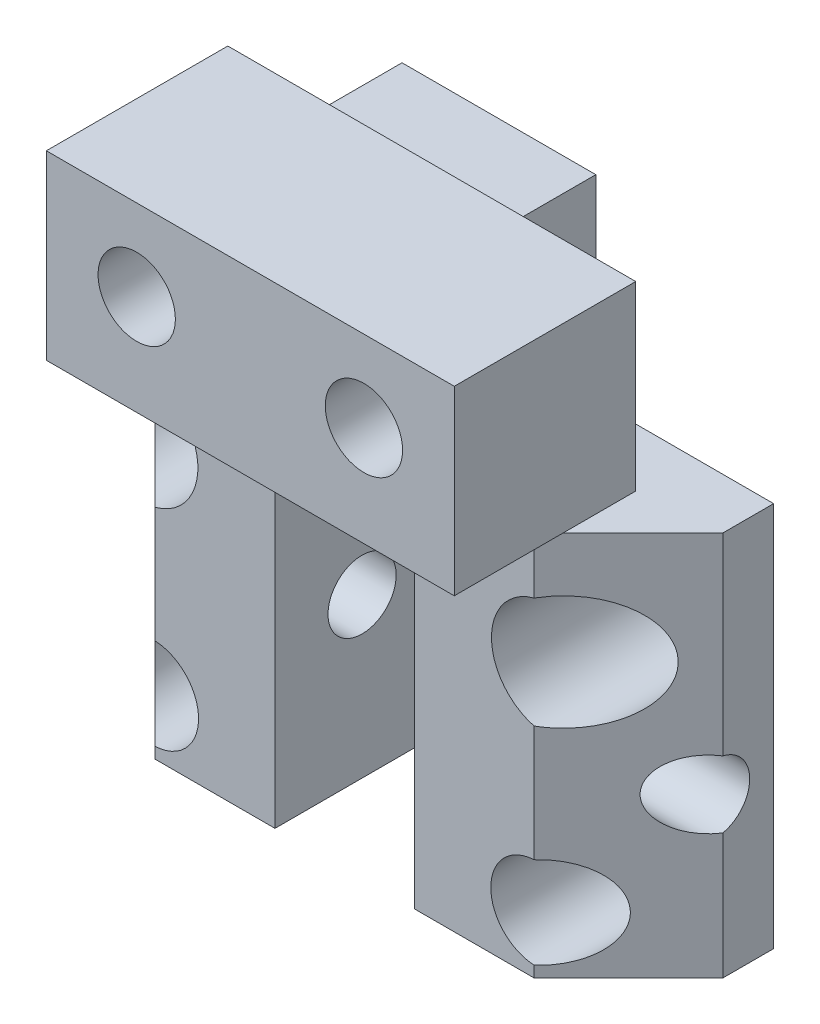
ISO-10303-21;
HEADER;
FILE_DESCRIPTION(('STEP AP214'),'2;1');
FILE_NAME('part.step','',(''),(''),'','','');
FILE_SCHEMA(('AUTOMOTIVE_DESIGN { 1 0 10303 214 1 1 1 1 }'));
ENDSEC;
DATA;
#1=APPLICATION_CONTEXT('core data for automotive mechanical design processes');
#2=APPLICATION_PROTOCOL_DEFINITION('international standard','automotive_design',2000,#1);
#3=PRODUCT_CONTEXT('',#1,'mechanical');
#4=PRODUCT('Part','Part','',(#3));
#5=PRODUCT_RELATED_PRODUCT_CATEGORY('part','',(#4));
#6=PRODUCT_DEFINITION_FORMATION('','',#4);
#7=PRODUCT_DEFINITION_CONTEXT('part definition',#1,'design');
#8=PRODUCT_DEFINITION('design','',#6,#7);
#9=PRODUCT_DEFINITION_SHAPE('','',#8);
#10=(LENGTH_UNIT() NAMED_UNIT(*) SI_UNIT(.MILLI.,.METRE.));
#11=(NAMED_UNIT(*) PLANE_ANGLE_UNIT() SI_UNIT($,.RADIAN.));
#12=(NAMED_UNIT(*) SI_UNIT($,.STERADIAN.) SOLID_ANGLE_UNIT());
#13=UNCERTAINTY_MEASURE_WITH_UNIT(LENGTH_MEASURE(1.E-05),#10,'distance_accuracy_value','');
#14=(GEOMETRIC_REPRESENTATION_CONTEXT(3) GLOBAL_UNCERTAINTY_ASSIGNED_CONTEXT((#13)) GLOBAL_UNIT_ASSIGNED_CONTEXT((#10,
#11,#12)) REPRESENTATION_CONTEXT('',''));
#15=CARTESIAN_POINT('',(0.,0.,0.));
#16=DIRECTION('',(0.,0.,1.));
#17=DIRECTION('',(1.,0.,0.));
#18=AXIS2_PLACEMENT_3D('',#15,#16,#17);
#19=CARTESIAN_POINT('',(-6.7818,-6.7437,0.));
#20=DIRECTION('',(0.,-1.,0.));
#21=DIRECTION('',(0.,0.,-1.));
#22=AXIS2_PLACEMENT_3D('',#19,#20,#21);
#23=PLANE('',#22);
#24=DIRECTION('',(1.,0.,0.));
#25=VECTOR('',#24,1.);
#26=CARTESIAN_POINT('',(13.081,-6.7437,5.08000000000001));
#27=LINE('',#26,#25);
#28=CARTESIAN_POINT('',(-3.4798,-6.7437,5.08000000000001));
#29=VERTEX_POINT('',#28);
#30=CARTESIAN_POINT('',(0.711199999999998,-6.7437,5.08000000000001));
#31=VERTEX_POINT('',#30);
#32=EDGE_CURVE('E267',#29,#31,#27,.T.);
#33=ORIENTED_EDGE('',*,*,#32,.F.);
#34=DIRECTION('',(0.707106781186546,0.,0.707106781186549));
#35=VECTOR('',#34,1.);
#36=CARTESIAN_POINT('',(-7.67079999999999,-6.7437,0.888999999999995));
#37=LINE('',#36,#35);
#38=CARTESIAN_POINT('',(-6.7818,-6.7437,1.77799999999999));
#39=VERTEX_POINT('',#38);
#40=EDGE_CURVE('E204',#29,#39,#37,.F.);
#41=ORIENTED_EDGE('',*,*,#40,.T.);
#42=DIRECTION('',(0.,0.,1.));
#43=VECTOR('',#42,1.);
#44=CARTESIAN_POINT('',(-6.7818,-6.7437,5.08000000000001));
#45=LINE('',#44,#43);
#46=CARTESIAN_POINT('',(-6.7818,-6.7437,-6.85799999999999));
#47=VERTEX_POINT('',#46);
#48=EDGE_CURVE('E281',#47,#39,#45,.T.);
#49=ORIENTED_EDGE('',*,*,#48,.F.);
#50=DIRECTION('',(-1.,0.,0.));
#51=VECTOR('',#50,1.);
#52=CARTESIAN_POINT('',(-6.7818,-6.7437,-6.85799999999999));
#53=LINE('',#52,#51);
#54=CARTESIAN_POINT('',(0.,-6.7437,-6.85799999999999));
#55=VERTEX_POINT('',#54);
#56=EDGE_CURVE('E290',#55,#47,#53,.T.);
#57=ORIENTED_EDGE('',*,*,#56,.F.);
#58=DIRECTION('',(0.,0.,-1.));
#59=VECTOR('',#58,1.);
#60=CARTESIAN_POINT('',(0.,-6.7437,-6.85799999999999));
#61=LINE('',#60,#59);
#62=CARTESIAN_POINT('',(0.,-6.7437,0.));
#63=VERTEX_POINT('',#62);
#64=EDGE_CURVE('E288',#63,#55,#61,.T.);
#65=ORIENTED_EDGE('',*,*,#64,.F.);
#66=DIRECTION('',(-1.,0.,0.));
#67=VECTOR('',#66,1.);
#68=CARTESIAN_POINT('',(0.,-6.7437,0.));
#69=LINE('',#68,#67);
#70=CARTESIAN_POINT('',(0.711199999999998,-6.7437,0.));
#71=VERTEX_POINT('',#70);
#72=EDGE_CURVE('E279',#71,#63,#69,.T.);
#73=ORIENTED_EDGE('',*,*,#72,.F.);
#74=DIRECTION('',(0.,0.,-1.));
#75=VECTOR('',#74,1.);
#76=CARTESIAN_POINT('',(0.711199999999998,-6.7437,0.));
#77=LINE('',#76,#75);
#78=EDGE_CURVE('E275',#31,#71,#77,.T.);
#79=ORIENTED_EDGE('',*,*,#78,.F.);
#80=EDGE_LOOP('',(#33,#41,#49,#57,#65,#73,#79));
#81=FACE_BOUND('',#80,.T.);
#82=ADVANCED_FACE('F34',(#81),#23,.T.);
#83=CARTESIAN_POINT('',(-6.7818,6.7437,0.));
#84=DIRECTION('',(0.,-1.,0.));
#85=DIRECTION('',(0.,0.,-1.));
#86=AXIS2_PLACEMENT_3D('',#83,#84,#85);
#87=PLANE('',#86);
#88=DIRECTION('',(0.,0.,1.));
#89=VECTOR('',#88,1.);
#90=CARTESIAN_POINT('',(-6.7818,6.7437,5.08000000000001));
#91=LINE('',#90,#89);
#92=CARTESIAN_POINT('',(-6.7818,6.7437,-6.85799999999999));
#93=VERTEX_POINT('',#92);
#94=CARTESIAN_POINT('',(-6.7818,6.7437,1.77799999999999));
#95=VERTEX_POINT('',#94);
#96=EDGE_CURVE('E292',#93,#95,#91,.T.);
#97=ORIENTED_EDGE('',*,*,#96,.T.);
#98=DIRECTION('',(-0.707106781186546,0.,-0.707106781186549));
#99=VECTOR('',#98,1.);
#100=CARTESIAN_POINT('',(-3.4798,6.7437,5.08000000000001));
#101=LINE('',#100,#99);
#102=CARTESIAN_POINT('',(-3.9878,6.7437,4.572));
#103=VERTEX_POINT('',#102);
#104=EDGE_CURVE('E203',#95,#103,#101,.F.);
#105=ORIENTED_EDGE('',*,*,#104,.T.);
#106=DIRECTION('',(0.,0.,1.));
#107=VECTOR('',#106,1.);
#108=CARTESIAN_POINT('',(-3.9878,6.7437,2.03200000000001));
#109=LINE('',#108,#107);
#110=CARTESIAN_POINT('',(-3.9878,6.7437,2.03200000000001));
#111=VERTEX_POINT('',#110);
#112=EDGE_CURVE('E408',#111,#103,#109,.T.);
#113=ORIENTED_EDGE('',*,*,#112,.F.);
#114=DIRECTION('',(-1.,0.,0.));
#115=VECTOR('',#114,1.);
#116=CARTESIAN_POINT('',(10.287,6.7437,2.03200000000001));
#117=LINE('',#116,#115);
#118=CARTESIAN_POINT('',(10.287,6.7437,2.03200000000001));
#119=VERTEX_POINT('',#118);
#120=EDGE_CURVE('E392',#119,#111,#117,.T.);
#121=ORIENTED_EDGE('',*,*,#120,.F.);
#122=DIRECTION('',(0.,0.,-1.));
#123=VECTOR('',#122,1.);
#124=CARTESIAN_POINT('',(10.287,6.7437,2.03200000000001));
#125=LINE('',#124,#123);
#126=CARTESIAN_POINT('',(10.287,6.7437,4.572));
#127=VERTEX_POINT('',#126);
#128=EDGE_CURVE('E306',#127,#119,#125,.T.);
#129=ORIENTED_EDGE('',*,*,#128,.F.);
#130=DIRECTION('',(-0.707106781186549,0.,0.707106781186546));
#131=VECTOR('',#130,1.);
#132=CARTESIAN_POINT('',(13.081,6.7437,1.77800000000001));
#133=LINE('',#132,#131);
#134=CARTESIAN_POINT('',(13.081,6.7437,1.77800000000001));
#135=VERTEX_POINT('',#134);
#136=EDGE_CURVE('E249',#127,#135,#133,.F.);
#137=ORIENTED_EDGE('',*,*,#136,.T.);
#138=DIRECTION('',(0.,0.,-1.));
#139=VECTOR('',#138,1.);
#140=CARTESIAN_POINT('',(13.081,6.7437,0.));
#141=LINE('',#140,#139);
#142=CARTESIAN_POINT('',(13.081,6.7437,0.));
#143=VERTEX_POINT('',#142);
#144=EDGE_CURVE('E334',#135,#143,#141,.T.);
#145=ORIENTED_EDGE('',*,*,#144,.T.);
#146=DIRECTION('',(-1.,0.,0.));
#147=VECTOR('',#146,1.);
#148=CARTESIAN_POINT('',(0.,6.7437,0.));
#149=LINE('',#148,#147);
#150=CARTESIAN_POINT('',(0.,6.7437,0.));
#151=VERTEX_POINT('',#150);
#152=EDGE_CURVE('E333',#143,#151,#149,.T.);
#153=ORIENTED_EDGE('',*,*,#152,.T.);
#154=DIRECTION('',(0.,0.,-1.));
#155=VECTOR('',#154,1.);
#156=CARTESIAN_POINT('',(0.,6.7437,-6.85799999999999));
#157=LINE('',#156,#155);
#158=CARTESIAN_POINT('',(0.,6.7437,-6.85799999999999));
#159=VERTEX_POINT('',#158);
#160=EDGE_CURVE('E427',#151,#159,#157,.T.);
#161=ORIENTED_EDGE('',*,*,#160,.T.);
#162=DIRECTION('',(-1.,0.,0.));
#163=VECTOR('',#162,1.);
#164=CARTESIAN_POINT('',(-6.7818,6.7437,-6.85799999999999));
#165=LINE('',#164,#163);
#166=EDGE_CURVE('E297',#159,#93,#165,.T.);
#167=ORIENTED_EDGE('',*,*,#166,.T.);
#168=EDGE_LOOP('',(#97,#105,#113,#121,#129,#137,#145,#153,#161,#167));
#169=FACE_BOUND('',#168,.T.);
#170=ADVANCED_FACE('F430',(#169),#87,.F.);
#171=CARTESIAN_POINT('',(-6.7818,6.7437,5.08000000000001));
#172=DIRECTION('',(1.,0.,0.));
#173=DIRECTION('',(0.,0.,-1.));
#174=AXIS2_PLACEMENT_3D('',#171,#172,#173);
#175=PLANE('',#174);
#176=DIRECTION('',(0.,1.,0.));
#177=VECTOR('',#176,1.);
#178=CARTESIAN_POINT('',(-6.7818,6.7437,1.77799999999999));
#179=LINE('',#178,#177);
#180=CARTESIAN_POINT('',(-6.7818,-2.34756579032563,1.77799999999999));
#181=VERTEX_POINT('',#180);
#182=EDGE_CURVE('E197',#39,#181,#179,.T.);
#183=ORIENTED_EDGE('',*,*,#182,.T.);
#184=CARTESIAN_POINT('',(-6.7818,-1.1811,2.03200000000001));
#185=DIRECTION('',(1.,0.,0.));
#186=DIRECTION('',(0.,0.,-1.));
#187=AXIS2_PLACEMENT_3D('',#184,#185,#186);
#188=CIRCLE('',#187,1.1938);
#189=CARTESIAN_POINT('',(-6.7818,-0.0146342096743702,1.77799999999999));
#190=VERTEX_POINT('',#189);
#191=EDGE_CURVE('E54',#181,#190,#188,.T.);
#192=ORIENTED_EDGE('',*,*,#191,.T.);
#193=EDGE_CURVE('E194',#190,#95,#179,.T.);
#194=ORIENTED_EDGE('',*,*,#193,.T.);
#195=ORIENTED_EDGE('',*,*,#96,.F.);
#196=DIRECTION('',(0.,-1.,0.));
#197=VECTOR('',#196,1.);
#198=CARTESIAN_POINT('',(-6.7818,6.7437,-6.85799999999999));
#199=LINE('',#198,#197);
#200=EDGE_CURVE('E293',#93,#47,#199,.T.);
#201=ORIENTED_EDGE('',*,*,#200,.T.);
#202=ORIENTED_EDGE('',*,*,#48,.T.);
#203=EDGE_LOOP('',(#183,#192,#194,#195,#201,#202));
#204=FACE_BOUND('',#203,.T.);
#205=ADVANCED_FACE('F192',(#204),#175,.F.);
#206=CARTESIAN_POINT('',(13.081,6.7437,5.08000000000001));
#207=DIRECTION('',(0.,0.,-1.));
#208=DIRECTION('',(-1.,0.,0.));
#209=AXIS2_PLACEMENT_3D('',#206,#207,#208);
#210=PLANE('',#209);
#211=DIRECTION('',(0.,1.,0.));
#212=VECTOR('',#211,1.);
#213=CARTESIAN_POINT('',(9.77899999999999,6.7437,5.08000000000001));
#214=LINE('',#213,#212);
#215=CARTESIAN_POINT('',(9.77899999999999,-3.15941679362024,5.08000000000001));
#216=VERTEX_POINT('',#215);
#217=CARTESIAN_POINT('',(9.77899999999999,0.892541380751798,5.08000000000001));
#218=VERTEX_POINT('',#217);
#219=EDGE_CURVE('E234',#216,#218,#214,.T.);
#220=ORIENTED_EDGE('',*,*,#219,.T.);
#221=CARTESIAN_POINT('',(10.29335,2.8321,5.08000000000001));
#222=DIRECTION('',(0.,0.,-1.));
#223=DIRECTION('',(-1.,0.,0.));
#224=AXIS2_PLACEMENT_3D('',#221,#222,#223);
#225=CIRCLE('',#224,2.0066);
#226=CARTESIAN_POINT('',(9.77899999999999,4.7716586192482,5.08000000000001));
#227=VERTEX_POINT('',#226);
#228=EDGE_CURVE('E223',#218,#227,#225,.T.);
#229=ORIENTED_EDGE('',*,*,#228,.T.);
#230=CARTESIAN_POINT('',(9.77899999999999,6.7437,5.08000000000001));
#231=VERTEX_POINT('',#230);
#232=EDGE_CURVE('E231',#227,#231,#214,.T.);
#233=ORIENTED_EDGE('',*,*,#232,.T.);
#234=DIRECTION('',(1.,0.,0.));
#235=VECTOR('',#234,1.);
#236=CARTESIAN_POINT('',(13.081,6.7437,5.08000000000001));
#237=LINE('',#236,#235);
#238=CARTESIAN_POINT('',(-3.4798,6.7437,5.08000000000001));
#239=VERTEX_POINT('',#238);
#240=EDGE_CURVE('E335',#239,#231,#237,.T.);
#241=ORIENTED_EDGE('',*,*,#240,.F.);
#242=DIRECTION('',(0.,-1.,0.));
#243=VECTOR('',#242,1.);
#244=CARTESIAN_POINT('',(-3.4798,6.7437,5.08000000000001));
#245=LINE('',#244,#243);
#246=CARTESIAN_POINT('',(-3.4798,4.7716586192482,5.08000000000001));
#247=VERTEX_POINT('',#246);
#248=EDGE_CURVE('E206',#239,#247,#245,.T.);
#249=ORIENTED_EDGE('',*,*,#248,.T.);
#250=CARTESIAN_POINT('',(-3.99415,2.8321,5.08000000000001));
#251=DIRECTION('',(0.,0.,-1.));
#252=DIRECTION('',(-1.,0.,0.));
#253=AXIS2_PLACEMENT_3D('',#250,#251,#252);
#254=CIRCLE('',#253,2.0066);
#255=CARTESIAN_POINT('',(-3.4798,0.892541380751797,5.08000000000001));
#256=VERTEX_POINT('',#255);
#257=EDGE_CURVE('E371',#247,#256,#254,.T.);
#258=ORIENTED_EDGE('',*,*,#257,.T.);
#259=CARTESIAN_POINT('',(-3.4798,-3.15941679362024,5.08000000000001));
#260=VERTEX_POINT('',#259);
#261=EDGE_CURVE('E258',#256,#260,#245,.T.);
#262=ORIENTED_EDGE('',*,*,#261,.T.);
#263=CARTESIAN_POINT('',(-3.56362,-4.75742,5.08000000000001));
#264=DIRECTION('',(0.,0.,-1.));
#265=DIRECTION('',(-1.,0.,0.));
#266=AXIS2_PLACEMENT_3D('',#263,#264,#265);
#267=CIRCLE('',#266,1.6002);
#268=CARTESIAN_POINT('',(-3.4798,-6.35542320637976,5.08000000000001));
#269=VERTEX_POINT('',#268);
#270=EDGE_CURVE('E269',#260,#269,#267,.T.);
#271=ORIENTED_EDGE('',*,*,#270,.T.);
#272=EDGE_CURVE('E255',#269,#29,#245,.T.);
#273=ORIENTED_EDGE('',*,*,#272,.T.);
#274=ORIENTED_EDGE('',*,*,#32,.T.);
#275=DIRECTION('',(0.,1.,0.));
#276=VECTOR('',#275,1.);
#277=CARTESIAN_POINT('',(0.7112,6.7437,5.08000000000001));
#278=LINE('',#277,#276);
#279=CARTESIAN_POINT('',(0.7112,5.9563,5.08000000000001));
#280=VERTEX_POINT('',#279);
#281=EDGE_CURVE('E387',#31,#280,#278,.T.);
#282=ORIENTED_EDGE('',*,*,#281,.T.);
#283=DIRECTION('',(1.,0.,0.));
#284=VECTOR('',#283,1.);
#285=CARTESIAN_POINT('',(13.081,5.9563,5.08000000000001));
#286=LINE('',#285,#284);
#287=CARTESIAN_POINT('',(5.588,5.9563,5.08000000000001));
#288=VERTEX_POINT('',#287);
#289=EDGE_CURVE('E389',#280,#288,#286,.T.);
#290=ORIENTED_EDGE('',*,*,#289,.T.);
#291=DIRECTION('',(0.,-1.,0.));
#292=VECTOR('',#291,1.);
#293=CARTESIAN_POINT('',(5.588,6.7437,5.08000000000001));
#294=LINE('',#293,#292);
#295=CARTESIAN_POINT('',(5.588,-6.7437,5.08000000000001));
#296=VERTEX_POINT('',#295);
#297=EDGE_CURVE('E383',#288,#296,#294,.T.);
#298=ORIENTED_EDGE('',*,*,#297,.T.);
#299=CARTESIAN_POINT('',(9.77899999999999,-6.7437,5.08000000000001));
#300=VERTEX_POINT('',#299);
#301=EDGE_CURVE('E277',#296,#300,#27,.T.);
#302=ORIENTED_EDGE('',*,*,#301,.T.);
#303=CARTESIAN_POINT('',(9.77899999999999,-6.35542320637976,5.08000000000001));
#304=VERTEX_POINT('',#303);
#305=EDGE_CURVE('E244',#300,#304,#214,.T.);
#306=ORIENTED_EDGE('',*,*,#305,.T.);
#307=CARTESIAN_POINT('',(9.86282,-4.75742,5.08000000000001));
#308=DIRECTION('',(0.,0.,-1.));
#309=DIRECTION('',(-1.,0.,0.));
#310=AXIS2_PLACEMENT_3D('',#307,#308,#309);
#311=CIRCLE('',#310,1.6002);
#312=EDGE_CURVE('E359',#304,#216,#311,.T.);
#313=ORIENTED_EDGE('',*,*,#312,.T.);
#314=EDGE_LOOP('',(#220,#229,#233,#241,#249,#258,#262,#271,#273,#274,#282,#290,#298,#302,#306,#313));
#315=FACE_BOUND('',#314,.T.);
#316=ADVANCED_FACE('F229',(#315),#210,.F.);
#317=CARTESIAN_POINT('',(13.081,6.7437,0.));
#318=DIRECTION('',(-1.,0.,0.));
#319=DIRECTION('',(0.,0.,1.));
#320=AXIS2_PLACEMENT_3D('',#317,#318,#319);
#321=PLANE('',#320);
#322=DIRECTION('',(0.,-1.,0.));
#323=VECTOR('',#322,1.);
#324=CARTESIAN_POINT('',(13.081,6.7437,1.77800000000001));
#325=LINE('',#324,#323);
#326=CARTESIAN_POINT('',(13.081,-0.0146342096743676,1.77800000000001));
#327=VERTEX_POINT('',#326);
#328=EDGE_CURVE('E245',#135,#327,#325,.T.);
#329=ORIENTED_EDGE('',*,*,#328,.T.);
#330=CARTESIAN_POINT('',(13.081,-1.1811,2.03200000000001));
#331=DIRECTION('',(1.,0.,0.));
#332=DIRECTION('',(0.,0.,-1.));
#333=AXIS2_PLACEMENT_3D('',#330,#331,#332);
#334=CIRCLE('',#333,1.1938);
#335=CARTESIAN_POINT('',(13.081,-2.34756579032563,1.77800000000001));
#336=VERTEX_POINT('',#335);
#337=EDGE_CURVE('E48',#336,#327,#334,.T.);
#338=ORIENTED_EDGE('',*,*,#337,.F.);
#339=CARTESIAN_POINT('',(13.081,-6.7437,1.77800000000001));
#340=VERTEX_POINT('',#339);
#341=EDGE_CURVE('E311',#336,#340,#325,.T.);
#342=ORIENTED_EDGE('',*,*,#341,.T.);
#343=DIRECTION('',(0.,0.,-1.));
#344=VECTOR('',#343,1.);
#345=CARTESIAN_POINT('',(13.081,-6.7437,0.));
#346=LINE('',#345,#344);
#347=CARTESIAN_POINT('',(13.081,-6.7437,0.));
#348=VERTEX_POINT('',#347);
#349=EDGE_CURVE('E276',#340,#348,#346,.T.);
#350=ORIENTED_EDGE('',*,*,#349,.T.);
#351=DIRECTION('',(0.,-1.,0.));
#352=VECTOR('',#351,1.);
#353=CARTESIAN_POINT('',(13.081,6.7437,0.));
#354=LINE('',#353,#352);
#355=EDGE_CURVE('E303',#143,#348,#354,.T.);
#356=ORIENTED_EDGE('',*,*,#355,.F.);
#357=ORIENTED_EDGE('',*,*,#144,.F.);
#358=EDGE_LOOP('',(#329,#338,#342,#350,#356,#357));
#359=FACE_BOUND('',#358,.T.);
#360=ADVANCED_FACE('F317',(#359),#321,.F.);
#361=CARTESIAN_POINT('',(0.,6.7437,0.));
#362=DIRECTION('',(0.,0.,1.));
#363=DIRECTION('',(1.,0.,0.));
#364=AXIS2_PLACEMENT_3D('',#361,#362,#363);
#365=PLANE('',#364);
#366=CARTESIAN_POINT('',(10.29335,2.8321,0.));
#367=DIRECTION('',(0.,0.,1.));
#368=DIRECTION('',(1.,0.,0.));
#369=AXIS2_PLACEMENT_3D('',#366,#367,#368);
#370=CIRCLE('',#369,2.0066);
#371=CARTESIAN_POINT('',(12.29995,2.8321,0.));
#372=VERTEX_POINT('',#371);
#373=EDGE_CURVE('E235',#372,#372,#370,.T.);
#374=ORIENTED_EDGE('',*,*,#373,.T.);
#375=EDGE_LOOP('',(#374));
#376=FACE_BOUND('',#375,.T.);
#377=CARTESIAN_POINT('',(9.86282,-4.75742,0.));
#378=DIRECTION('',(0.,0.,1.));
#379=DIRECTION('',(1.,0.,0.));
#380=AXIS2_PLACEMENT_3D('',#377,#378,#379);
#381=CIRCLE('',#380,1.6002);
#382=CARTESIAN_POINT('',(11.46302,-4.75742,0.));
#383=VERTEX_POINT('',#382);
#384=EDGE_CURVE('E361',#383,#383,#381,.T.);
#385=ORIENTED_EDGE('',*,*,#384,.T.);
#386=EDGE_LOOP('',(#385));
#387=FACE_BOUND('',#386,.T.);
#388=DIRECTION('',(1.,0.,0.));
#389=VECTOR('',#388,1.);
#390=CARTESIAN_POINT('',(0.7112,5.9563,0.));
#391=LINE('',#390,#389);
#392=CARTESIAN_POINT('',(0.7112,5.9563,0.));
#393=VERTEX_POINT('',#392);
#394=CARTESIAN_POINT('',(5.588,5.9563,0.));
#395=VERTEX_POINT('',#394);
#396=EDGE_CURVE('E376',#393,#395,#391,.T.);
#397=ORIENTED_EDGE('',*,*,#396,.F.);
#398=DIRECTION('',(0.,1.,0.));
#399=VECTOR('',#398,1.);
#400=CARTESIAN_POINT('',(0.7112,5.9563,0.));
#401=LINE('',#400,#399);
#402=EDGE_CURVE('E373',#71,#393,#401,.T.);
#403=ORIENTED_EDGE('',*,*,#402,.F.);
#404=ORIENTED_EDGE('',*,*,#72,.T.);
#405=DIRECTION('',(0.,-1.,0.));
#406=VECTOR('',#405,1.);
#407=CARTESIAN_POINT('',(0.,6.7437,0.));
#408=LINE('',#407,#406);
#409=EDGE_CURVE('E300',#151,#63,#408,.T.);
#410=ORIENTED_EDGE('',*,*,#409,.F.);
#411=ORIENTED_EDGE('',*,*,#152,.F.);
#412=ORIENTED_EDGE('',*,*,#355,.T.);
#413=CARTESIAN_POINT('',(5.588,-6.7437,0.));
#414=VERTEX_POINT('',#413);
#415=EDGE_CURVE('E285',#348,#414,#69,.T.);
#416=ORIENTED_EDGE('',*,*,#415,.T.);
#417=DIRECTION('',(0.,-1.,0.));
#418=VECTOR('',#417,1.);
#419=CARTESIAN_POINT('',(5.588,5.9563,0.));
#420=LINE('',#419,#418);
#421=EDGE_CURVE('E330',#395,#414,#420,.T.);
#422=ORIENTED_EDGE('',*,*,#421,.F.);
#423=EDGE_LOOP('',(#397,#403,#404,#410,#411,#412,#416,#422));
#424=FACE_BOUND('',#423,.T.);
#425=ADVANCED_FACE('F329',(#376,#387,#424),#365,.F.);
#426=CARTESIAN_POINT('',(0.,6.7437,-6.85799999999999));
#427=DIRECTION('',(-1.,0.,0.));
#428=DIRECTION('',(0.,0.,1.));
#429=AXIS2_PLACEMENT_3D('',#426,#427,#428);
#430=PLANE('',#429);
#431=ORIENTED_EDGE('',*,*,#64,.T.);
#432=DIRECTION('',(0.,-1.,0.));
#433=VECTOR('',#432,1.);
#434=CARTESIAN_POINT('',(0.,6.7437,-6.85799999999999));
#435=LINE('',#434,#433);
#436=EDGE_CURVE('E296',#159,#55,#435,.T.);
#437=ORIENTED_EDGE('',*,*,#436,.F.);
#438=ORIENTED_EDGE('',*,*,#160,.F.);
#439=ORIENTED_EDGE('',*,*,#409,.T.);
#440=EDGE_LOOP('',(#431,#437,#438,#439));
#441=FACE_BOUND('',#440,.T.);
#442=ADVANCED_FACE('F438',(#441),#430,.F.);
#443=CARTESIAN_POINT('',(-6.7818,6.7437,-6.85799999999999));
#444=DIRECTION('',(0.,0.,1.));
#445=DIRECTION('',(1.,0.,0.));
#446=AXIS2_PLACEMENT_3D('',#443,#444,#445);
#447=PLANE('',#446);
#448=CARTESIAN_POINT('',(-3.56362,-4.75742,-6.85799999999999));
#449=DIRECTION('',(0.,0.,-1.));
#450=DIRECTION('',(-1.,0.,0.));
#451=AXIS2_PLACEMENT_3D('',#448,#449,#450);
#452=CIRCLE('',#451,1.6002);
#453=CARTESIAN_POINT('',(-5.16382,-4.75742,-6.85799999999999));
#454=VERTEX_POINT('',#453);
#455=EDGE_CURVE('E364',#454,#454,#452,.T.);
#456=ORIENTED_EDGE('',*,*,#455,.F.);
#457=EDGE_LOOP('',(#456));
#458=FACE_BOUND('',#457,.T.);
#459=CARTESIAN_POINT('',(-3.99415,2.8321,-6.85799999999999));
#460=DIRECTION('',(0.,0.,-1.));
#461=DIRECTION('',(-1.,0.,0.));
#462=AXIS2_PLACEMENT_3D('',#459,#460,#461);
#463=CIRCLE('',#462,2.0066);
#464=CARTESIAN_POINT('',(-6.00075,2.8321,-6.85799999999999));
#465=VERTEX_POINT('',#464);
#466=EDGE_CURVE('E368',#465,#465,#463,.T.);
#467=ORIENTED_EDGE('',*,*,#466,.F.);
#468=EDGE_LOOP('',(#467));
#469=FACE_BOUND('',#468,.T.);
#470=ORIENTED_EDGE('',*,*,#56,.T.);
#471=ORIENTED_EDGE('',*,*,#200,.F.);
#472=ORIENTED_EDGE('',*,*,#166,.F.);
#473=ORIENTED_EDGE('',*,*,#436,.T.);
#474=EDGE_LOOP('',(#470,#471,#472,#473));
#475=FACE_BOUND('',#474,.T.);
#476=ADVANCED_FACE('F434',(#458,#469,#475),#447,.F.);
#477=ORIENTED_EDGE('',*,*,#349,.F.);
#478=DIRECTION('',(0.707106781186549,0.,-0.707106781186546));
#479=VECTOR('',#478,1.);
#480=CARTESIAN_POINT('',(4.03859999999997,-6.7437,10.8204));
#481=LINE('',#480,#479);
#482=EDGE_CURVE('E242',#340,#300,#481,.F.);
#483=ORIENTED_EDGE('',*,*,#482,.T.);
#484=ORIENTED_EDGE('',*,*,#301,.F.);
#485=DIRECTION('',(0.,0.,1.));
#486=VECTOR('',#485,1.);
#487=CARTESIAN_POINT('',(5.588,-6.7437,0.));
#488=LINE('',#487,#486);
#489=EDGE_CURVE('E307',#414,#296,#488,.T.);
#490=ORIENTED_EDGE('',*,*,#489,.F.);
#491=ORIENTED_EDGE('',*,*,#415,.F.);
#492=EDGE_LOOP('',(#477,#483,#484,#490,#491));
#493=FACE_BOUND('',#492,.T.);
#494=ADVANCED_FACE('F324',(#493),#23,.T.);
#495=CARTESIAN_POINT('',(10.287,13.0937,2.03200000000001));
#496=DIRECTION('',(-1.,0.,0.));
#497=DIRECTION('',(0.,0.,1.));
#498=AXIS2_PLACEMENT_3D('',#495,#496,#497);
#499=PLANE('',#498);
#500=DIRECTION('',(0.,-1.,0.));
#501=VECTOR('',#500,1.);
#502=CARTESIAN_POINT('',(10.287,13.0937,8.38200000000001));
#503=LINE('',#502,#501);
#504=CARTESIAN_POINT('',(10.287,13.0937,8.38200000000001));
#505=VERTEX_POINT('',#504);
#506=CARTESIAN_POINT('',(10.287,6.7437,8.38200000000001));
#507=VERTEX_POINT('',#506);
#508=EDGE_CURVE('E403',#505,#507,#503,.T.);
#509=ORIENTED_EDGE('',*,*,#508,.T.);
#510=EDGE_CURVE('E309',#507,#127,#125,.T.);
#511=ORIENTED_EDGE('',*,*,#510,.T.);
#512=ORIENTED_EDGE('',*,*,#128,.T.);
#513=DIRECTION('',(0.,-1.,0.));
#514=VECTOR('',#513,1.);
#515=CARTESIAN_POINT('',(10.287,13.0937,2.03200000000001));
#516=LINE('',#515,#514);
#517=CARTESIAN_POINT('',(10.287,13.0937,2.03200000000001));
#518=VERTEX_POINT('',#517);
#519=EDGE_CURVE('E421',#518,#119,#516,.T.);
#520=ORIENTED_EDGE('',*,*,#519,.F.);
#521=DIRECTION('',(0.,0.,-1.));
#522=VECTOR('',#521,1.);
#523=CARTESIAN_POINT('',(10.287,13.0937,2.03200000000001));
#524=LINE('',#523,#522);
#525=EDGE_CURVE('E393',#505,#518,#524,.T.);
#526=ORIENTED_EDGE('',*,*,#525,.F.);
#527=EDGE_LOOP('',(#509,#511,#512,#520,#526));
#528=FACE_BOUND('',#527,.T.);
#529=ADVANCED_FACE('F467',(#528),#499,.F.);
#530=CARTESIAN_POINT('',(10.287,13.0937,2.03200000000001));
#531=DIRECTION('',(0.,0.,1.));
#532=DIRECTION('',(1.,0.,0.));
#533=AXIS2_PLACEMENT_3D('',#530,#531,#532);
#534=PLANE('',#533);
#535=CARTESIAN_POINT('',(7.1247,10.2489,2.03200000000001));
#536=DIRECTION('',(0.,0.,1.));
#537=DIRECTION('',(1.,0.,0.));
#538=AXIS2_PLACEMENT_3D('',#535,#536,#537);
#539=CIRCLE('',#538,1.35255);
#540=CARTESIAN_POINT('',(8.47725,10.2489,2.03200000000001));
#541=VERTEX_POINT('',#540);
#542=EDGE_CURVE('E349',#541,#541,#539,.T.);
#543=ORIENTED_EDGE('',*,*,#542,.T.);
#544=EDGE_LOOP('',(#543));
#545=FACE_BOUND('',#544,.T.);
#546=CARTESIAN_POINT('',(-0.825499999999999,10.2489,2.03200000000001));
#547=DIRECTION('',(0.,0.,1.));
#548=DIRECTION('',(1.,0.,0.));
#549=AXIS2_PLACEMENT_3D('',#546,#547,#548);
#550=CIRCLE('',#549,1.35255);
#551=CARTESIAN_POINT('',(0.527049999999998,10.2489,2.03200000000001));
#552=VERTEX_POINT('',#551);
#553=EDGE_CURVE('E236',#552,#552,#550,.T.);
#554=ORIENTED_EDGE('',*,*,#553,.T.);
#555=EDGE_LOOP('',(#554));
#556=FACE_BOUND('',#555,.T.);
#557=ORIENTED_EDGE('',*,*,#120,.T.);
#558=DIRECTION('',(0.,-1.,0.));
#559=VECTOR('',#558,1.);
#560=CARTESIAN_POINT('',(-3.9878,13.0937,2.03200000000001));
#561=LINE('',#560,#559);
#562=CARTESIAN_POINT('',(-3.9878,13.0937,2.03200000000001));
#563=VERTEX_POINT('',#562);
#564=EDGE_CURVE('E418',#563,#111,#561,.T.);
#565=ORIENTED_EDGE('',*,*,#564,.F.);
#566=DIRECTION('',(-1.,0.,0.));
#567=VECTOR('',#566,1.);
#568=CARTESIAN_POINT('',(10.287,13.0937,2.03200000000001));
#569=LINE('',#568,#567);
#570=EDGE_CURVE('E396',#518,#563,#569,.T.);
#571=ORIENTED_EDGE('',*,*,#570,.F.);
#572=ORIENTED_EDGE('',*,*,#519,.T.);
#573=EDGE_LOOP('',(#557,#565,#571,#572));
#574=FACE_BOUND('',#573,.T.);
#575=ADVANCED_FACE('F472',(#545,#556,#574),#534,.F.);
#576=CARTESIAN_POINT('',(-3.9878,13.0937,2.03200000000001));
#577=DIRECTION('',(1.,0.,0.));
#578=DIRECTION('',(0.,0.,-1.));
#579=AXIS2_PLACEMENT_3D('',#576,#577,#578);
#580=PLANE('',#579);
#581=ORIENTED_EDGE('',*,*,#112,.T.);
#582=CARTESIAN_POINT('',(-3.9878,6.7437,8.38200000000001));
#583=VERTEX_POINT('',#582);
#584=EDGE_CURVE('E407',#103,#583,#109,.T.);
#585=ORIENTED_EDGE('',*,*,#584,.T.);
#586=DIRECTION('',(0.,-1.,0.));
#587=VECTOR('',#586,1.);
#588=CARTESIAN_POINT('',(-3.9878,13.0937,8.38200000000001));
#589=LINE('',#588,#587);
#590=CARTESIAN_POINT('',(-3.9878,13.0937,8.38200000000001));
#591=VERTEX_POINT('',#590);
#592=EDGE_CURVE('E415',#591,#583,#589,.T.);
#593=ORIENTED_EDGE('',*,*,#592,.F.);
#594=DIRECTION('',(0.,0.,1.));
#595=VECTOR('',#594,1.);
#596=CARTESIAN_POINT('',(-3.9878,13.0937,2.03200000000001));
#597=LINE('',#596,#595);
#598=EDGE_CURVE('E399',#563,#591,#597,.T.);
#599=ORIENTED_EDGE('',*,*,#598,.F.);
#600=ORIENTED_EDGE('',*,*,#564,.T.);
#601=EDGE_LOOP('',(#581,#585,#593,#599,#600));
#602=FACE_BOUND('',#601,.T.);
#603=ADVANCED_FACE('F564',(#602),#580,.F.);
#604=CARTESIAN_POINT('',(10.287,13.0937,8.38200000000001));
#605=DIRECTION('',(0.,0.,-1.));
#606=DIRECTION('',(-1.,0.,0.));
#607=AXIS2_PLACEMENT_3D('',#604,#605,#606);
#608=PLANE('',#607);
#609=CARTESIAN_POINT('',(7.1247,10.2489,8.38200000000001));
#610=DIRECTION('',(0.,0.,1.));
#611=DIRECTION('',(1.,0.,0.));
#612=AXIS2_PLACEMENT_3D('',#609,#610,#611);
#613=CIRCLE('',#612,1.35255);
#614=CARTESIAN_POINT('',(8.47725,10.2489,8.38200000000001));
#615=VERTEX_POINT('',#614);
#616=EDGE_CURVE('E346',#615,#615,#613,.T.);
#617=ORIENTED_EDGE('',*,*,#616,.F.);
#618=EDGE_LOOP('',(#617));
#619=FACE_BOUND('',#618,.T.);
#620=CARTESIAN_POINT('',(-0.825499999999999,10.2489,8.38200000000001));
#621=DIRECTION('',(0.,0.,1.));
#622=DIRECTION('',(1.,0.,0.));
#623=AXIS2_PLACEMENT_3D('',#620,#621,#622);
#624=CIRCLE('',#623,1.35255);
#625=CARTESIAN_POINT('',(0.527049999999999,10.2489,8.38200000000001));
#626=VERTEX_POINT('',#625);
#627=EDGE_CURVE('E352',#626,#626,#624,.T.);
#628=ORIENTED_EDGE('',*,*,#627,.F.);
#629=EDGE_LOOP('',(#628));
#630=FACE_BOUND('',#629,.T.);
#631=DIRECTION('',(1.,0.,0.));
#632=VECTOR('',#631,1.);
#633=CARTESIAN_POINT('',(10.287,6.7437,8.38200000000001));
#634=LINE('',#633,#632);
#635=EDGE_CURVE('E397',#583,#507,#634,.T.);
#636=ORIENTED_EDGE('',*,*,#635,.T.);
#637=ORIENTED_EDGE('',*,*,#508,.F.);
#638=DIRECTION('',(1.,0.,0.));
#639=VECTOR('',#638,1.);
#640=CARTESIAN_POINT('',(10.287,13.0937,8.38200000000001));
#641=LINE('',#640,#639);
#642=EDGE_CURVE('E401',#591,#505,#641,.T.);
#643=ORIENTED_EDGE('',*,*,#642,.F.);
#644=ORIENTED_EDGE('',*,*,#592,.T.);
#645=EDGE_LOOP('',(#636,#637,#643,#644));
#646=FACE_BOUND('',#645,.T.);
#647=ADVANCED_FACE('F526',(#619,#630,#646),#608,.F.);
#648=CARTESIAN_POINT('',(10.287,13.0937,2.03200000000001));
#649=DIRECTION('',(0.,-1.,0.));
#650=DIRECTION('',(0.,0.,-1.));
#651=AXIS2_PLACEMENT_3D('',#648,#649,#650);
#652=PLANE('',#651);
#653=ORIENTED_EDGE('',*,*,#525,.T.);
#654=ORIENTED_EDGE('',*,*,#570,.T.);
#655=ORIENTED_EDGE('',*,*,#598,.T.);
#656=ORIENTED_EDGE('',*,*,#642,.T.);
#657=EDGE_LOOP('',(#653,#654,#655,#656));
#658=FACE_BOUND('',#657,.T.);
#659=ADVANCED_FACE('F520',(#658),#652,.F.);
#660=CARTESIAN_POINT('',(10.287,6.7437,2.03200000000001));
#661=DIRECTION('',(0.,-1.,0.));
#662=DIRECTION('',(0.,0.,-1.));
#663=AXIS2_PLACEMENT_3D('',#660,#661,#662);
#664=PLANE('',#663);
#665=ORIENTED_EDGE('',*,*,#584,.F.);
#666=DIRECTION('',(-0.707106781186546,0.,-0.707106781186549));
#667=VECTOR('',#666,1.);
#668=CARTESIAN_POINT('',(-3.4798,6.7437,5.08000000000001));
#669=LINE('',#668,#667);
#670=EDGE_CURVE('E211',#103,#239,#669,.F.);
#671=ORIENTED_EDGE('',*,*,#670,.T.);
#672=ORIENTED_EDGE('',*,*,#240,.T.);
#673=DIRECTION('',(-0.707106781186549,0.,0.707106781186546));
#674=VECTOR('',#673,1.);
#675=CARTESIAN_POINT('',(13.081,6.7437,1.77800000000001));
#676=LINE('',#675,#674);
#677=EDGE_CURVE('E241',#231,#127,#676,.F.);
#678=ORIENTED_EDGE('',*,*,#677,.T.);
#679=ORIENTED_EDGE('',*,*,#510,.F.);
#680=ORIENTED_EDGE('',*,*,#635,.F.);
#681=EDGE_LOOP('',(#665,#671,#672,#678,#679,#680));
#682=FACE_BOUND('',#681,.T.);
#683=ADVANCED_FACE('F525',(#682),#664,.T.);
#684=CARTESIAN_POINT('',(0.7112,5.9563,8.38200000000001));
#685=DIRECTION('',(0.,1.,0.));
#686=DIRECTION('',(-1.,0.,0.));
#687=AXIS2_PLACEMENT_3D('',#684,#685,#686);
#688=PLANE('',#687);
#689=DIRECTION('',(0.,0.,-1.));
#690=VECTOR('',#689,1.);
#691=CARTESIAN_POINT('',(0.7112,5.9563,8.38200000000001));
#692=LINE('',#691,#690);
#693=EDGE_CURVE('E380',#280,#393,#692,.T.);
#694=ORIENTED_EDGE('',*,*,#693,.T.);
#695=ORIENTED_EDGE('',*,*,#396,.T.);
#696=DIRECTION('',(0.,0.,-1.));
#697=VECTOR('',#696,1.);
#698=CARTESIAN_POINT('',(5.588,5.9563,8.38200000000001));
#699=LINE('',#698,#697);
#700=EDGE_CURVE('E381',#288,#395,#699,.T.);
#701=ORIENTED_EDGE('',*,*,#700,.F.);
#702=ORIENTED_EDGE('',*,*,#289,.F.);
#703=EDGE_LOOP('',(#694,#695,#701,#702));
#704=FACE_BOUND('',#703,.T.);
#705=ADVANCED_FACE('F445',(#704),#688,.F.);
#706=CARTESIAN_POINT('',(0.7112,5.9563,8.38200000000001));
#707=DIRECTION('',(-1.,0.,0.));
#708=DIRECTION('',(0.,-1.,0.));
#709=AXIS2_PLACEMENT_3D('',#706,#707,#708);
#710=PLANE('',#709);
#711=CARTESIAN_POINT('',(0.711199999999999,-1.1811,2.03200000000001));
#712=DIRECTION('',(-1.,0.,0.));
#713=DIRECTION('',(0.,-1.,0.));
#714=AXIS2_PLACEMENT_3D('',#711,#712,#713);
#715=CIRCLE('',#714,1.1938);
#716=CARTESIAN_POINT('',(0.711199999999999,-2.3749,2.03200000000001));
#717=VERTEX_POINT('',#716);
#718=EDGE_CURVE('E340',#717,#717,#715,.T.);
#719=ORIENTED_EDGE('',*,*,#718,.T.);
#720=EDGE_LOOP('',(#719));
#721=FACE_BOUND('',#720,.T.);
#722=ORIENTED_EDGE('',*,*,#78,.T.);
#723=ORIENTED_EDGE('',*,*,#402,.T.);
#724=ORIENTED_EDGE('',*,*,#693,.F.);
#725=ORIENTED_EDGE('',*,*,#281,.F.);
#726=EDGE_LOOP('',(#722,#723,#724,#725));
#727=FACE_BOUND('',#726,.T.);
#728=ADVANCED_FACE('F442',(#721,#727),#710,.F.);
#729=CARTESIAN_POINT('',(5.588,5.9563,8.38200000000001));
#730=DIRECTION('',(1.,0.,0.));
#731=DIRECTION('',(0.,1.,0.));
#732=AXIS2_PLACEMENT_3D('',#729,#730,#731);
#733=PLANE('',#732);
#734=CARTESIAN_POINT('',(5.588,-1.1811,2.03200000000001));
#735=DIRECTION('',(1.,0.,0.));
#736=DIRECTION('',(0.,1.,0.));
#737=AXIS2_PLACEMENT_3D('',#734,#735,#736);
#738=CIRCLE('',#737,1.1938);
#739=CARTESIAN_POINT('',(5.588,0.0127000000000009,2.03200000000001));
#740=VERTEX_POINT('',#739);
#741=EDGE_CURVE('E337',#740,#740,#738,.T.);
#742=ORIENTED_EDGE('',*,*,#741,.T.);
#743=EDGE_LOOP('',(#742));
#744=FACE_BOUND('',#743,.T.);
#745=ORIENTED_EDGE('',*,*,#700,.T.);
#746=ORIENTED_EDGE('',*,*,#421,.T.);
#747=ORIENTED_EDGE('',*,*,#489,.T.);
#748=ORIENTED_EDGE('',*,*,#297,.F.);
#749=EDGE_LOOP('',(#745,#746,#747,#748));
#750=FACE_BOUND('',#749,.T.);
#751=ADVANCED_FACE('F447',(#744,#750),#733,.F.);
#752=CARTESIAN_POINT('',(13.081,6.7437,1.77800000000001));
#753=DIRECTION('',(-0.707106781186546,0.,-0.707106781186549));
#754=DIRECTION('',(-0.707106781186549,0.,0.707106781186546));
#755=AXIS2_PLACEMENT_3D('',#752,#753,#754);
#756=PLANE('',#755);
#757=CARTESIAN_POINT('',(12.827,-1.1811,2.03200000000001));
#758=DIRECTION('',(-0.707106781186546,0.,-0.707106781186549));
#759=DIRECTION('',(0.707106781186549,0.,-0.707106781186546));
#760=AXIS2_PLACEMENT_3D('',#757,#758,#759);
#761=ELLIPSE('',#760,1.688288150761,1.1938);
#762=EDGE_CURVE('E198',#327,#336,#761,.F.);
#763=ORIENTED_EDGE('',*,*,#762,.F.);
#764=ORIENTED_EDGE('',*,*,#328,.F.);
#765=ORIENTED_EDGE('',*,*,#136,.F.);
#766=ORIENTED_EDGE('',*,*,#677,.F.);
#767=ORIENTED_EDGE('',*,*,#232,.F.);
#768=CARTESIAN_POINT('',(10.29335,2.8321,4.56565));
#769=DIRECTION('',(-0.707106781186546,0.,-0.707106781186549));
#770=DIRECTION('',(0.707106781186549,0.,-0.707106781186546));
#771=AXIS2_PLACEMENT_3D('',#768,#769,#770);
#772=ELLIPSE('',#771,2.83776093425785,2.0066);
#773=EDGE_CURVE('E42',#218,#227,#772,.F.);
#774=ORIENTED_EDGE('',*,*,#773,.F.);
#775=ORIENTED_EDGE('',*,*,#219,.F.);
#776=CARTESIAN_POINT('',(9.86282,-4.75742,4.99618));
#777=DIRECTION('',(-0.707106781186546,0.,-0.707106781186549));
#778=DIRECTION('',(0.707106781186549,0.,-0.707106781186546));
#779=AXIS2_PLACEMENT_3D('',#776,#777,#778);
#780=ELLIPSE('',#779,2.26302454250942,1.6002);
#781=EDGE_CURVE('E217',#304,#216,#780,.F.);
#782=ORIENTED_EDGE('',*,*,#781,.F.);
#783=ORIENTED_EDGE('',*,*,#305,.F.);
#784=ORIENTED_EDGE('',*,*,#482,.F.);
#785=ORIENTED_EDGE('',*,*,#341,.F.);
#786=EDGE_LOOP('',(#763,#764,#765,#766,#767,#774,#775,#782,#783,#784,#785));
#787=FACE_BOUND('',#786,.T.);
#788=ADVANCED_FACE('F239',(#787),#756,.F.);
#789=CARTESIAN_POINT('',(-3.4798,6.7437,5.08000000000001));
#790=DIRECTION('',(0.707106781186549,0.,-0.707106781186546));
#791=DIRECTION('',(-0.707106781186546,0.,-0.707106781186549));
#792=AXIS2_PLACEMENT_3D('',#789,#790,#791);
#793=PLANE('',#792);
#794=CARTESIAN_POINT('',(-6.52779999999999,-1.1811,2.03200000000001));
#795=DIRECTION('',(0.707106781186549,0.,-0.707106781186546));
#796=DIRECTION('',(0.707106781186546,0.,0.707106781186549));
#797=AXIS2_PLACEMENT_3D('',#794,#795,#796);
#798=ELLIPSE('',#797,1.688288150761,1.1938);
#799=EDGE_CURVE('E11',#181,#190,#798,.F.);
#800=ORIENTED_EDGE('',*,*,#799,.F.);
#801=ORIENTED_EDGE('',*,*,#182,.F.);
#802=ORIENTED_EDGE('',*,*,#40,.F.);
#803=ORIENTED_EDGE('',*,*,#272,.F.);
#804=CARTESIAN_POINT('',(-3.56362,-4.75742,4.99618));
#805=DIRECTION('',(0.707106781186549,0.,-0.707106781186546));
#806=DIRECTION('',(-0.707106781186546,0.,-0.707106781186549));
#807=AXIS2_PLACEMENT_3D('',#804,#805,#806);
#808=ELLIPSE('',#807,2.26302454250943,1.6002);
#809=EDGE_CURVE('E215',#260,#269,#808,.F.);
#810=ORIENTED_EDGE('',*,*,#809,.F.);
#811=ORIENTED_EDGE('',*,*,#261,.F.);
#812=CARTESIAN_POINT('',(-3.99415,2.8321,4.56565));
#813=DIRECTION('',(0.707106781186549,0.,-0.707106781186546));
#814=DIRECTION('',(-0.707106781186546,0.,-0.707106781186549));
#815=AXIS2_PLACEMENT_3D('',#812,#813,#814);
#816=ELLIPSE('',#815,2.83776093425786,2.0066);
#817=EDGE_CURVE('E213',#247,#256,#816,.F.);
#818=ORIENTED_EDGE('',*,*,#817,.F.);
#819=ORIENTED_EDGE('',*,*,#248,.F.);
#820=ORIENTED_EDGE('',*,*,#670,.F.);
#821=ORIENTED_EDGE('',*,*,#104,.F.);
#822=ORIENTED_EDGE('',*,*,#193,.F.);
#823=EDGE_LOOP('',(#800,#801,#802,#803,#810,#811,#818,#819,#820,#821,#822));
#824=FACE_BOUND('',#823,.T.);
#825=ADVANCED_FACE('F36',(#824),#793,.F.);
#826=CARTESIAN_POINT('',(-3.99415,2.8321,8.38200000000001));
#827=DIRECTION('',(0.,0.,-1.));
#828=DIRECTION('',(-1.,0.,0.));
#829=AXIS2_PLACEMENT_3D('',#826,#827,#828);
#830=CYLINDRICAL_SURFACE('',#829,2.0066);
#831=ORIENTED_EDGE('',*,*,#466,.T.);
#832=EDGE_LOOP('',(#831));
#833=FACE_BOUND('',#832,.T.);
#834=ORIENTED_EDGE('',*,*,#817,.T.);
#835=ORIENTED_EDGE('',*,*,#257,.F.);
#836=EDGE_LOOP('',(#834,#835));
#837=FACE_BOUND('',#836,.T.);
#838=ADVANCED_FACE('F603',(#833,#837),#830,.F.);
#839=CARTESIAN_POINT('',(-3.56362,-4.75742,8.38200000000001));
#840=DIRECTION('',(0.,0.,-1.));
#841=DIRECTION('',(-1.,0.,0.));
#842=AXIS2_PLACEMENT_3D('',#839,#840,#841);
#843=CYLINDRICAL_SURFACE('',#842,1.6002);
#844=ORIENTED_EDGE('',*,*,#455,.T.);
#845=EDGE_LOOP('',(#844));
#846=FACE_BOUND('',#845,.T.);
#847=ORIENTED_EDGE('',*,*,#809,.T.);
#848=ORIENTED_EDGE('',*,*,#270,.F.);
#849=EDGE_LOOP('',(#847,#848));
#850=FACE_BOUND('',#849,.T.);
#851=ADVANCED_FACE('F605',(#846,#850),#843,.F.);
#852=CARTESIAN_POINT('',(9.86282,-4.75742,8.38200000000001));
#853=DIRECTION('',(0.,0.,-1.));
#854=DIRECTION('',(-1.,0.,0.));
#855=AXIS2_PLACEMENT_3D('',#852,#853,#854);
#856=CYLINDRICAL_SURFACE('',#855,1.6002);
#857=ORIENTED_EDGE('',*,*,#781,.T.);
#858=ORIENTED_EDGE('',*,*,#312,.F.);
#859=EDGE_LOOP('',(#857,#858));
#860=FACE_BOUND('',#859,.T.);
#861=ORIENTED_EDGE('',*,*,#384,.F.);
#862=EDGE_LOOP('',(#861));
#863=FACE_BOUND('',#862,.T.);
#864=ADVANCED_FACE('F611',(#860,#863),#856,.F.);
#865=CARTESIAN_POINT('',(10.29335,2.8321,8.38200000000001));
#866=DIRECTION('',(0.,0.,-1.));
#867=DIRECTION('',(-1.,0.,0.));
#868=AXIS2_PLACEMENT_3D('',#865,#866,#867);
#869=CYLINDRICAL_SURFACE('',#868,2.0066);
#870=ORIENTED_EDGE('',*,*,#773,.T.);
#871=ORIENTED_EDGE('',*,*,#228,.F.);
#872=EDGE_LOOP('',(#870,#871));
#873=FACE_BOUND('',#872,.T.);
#874=ORIENTED_EDGE('',*,*,#373,.F.);
#875=EDGE_LOOP('',(#874));
#876=FACE_BOUND('',#875,.T.);
#877=ADVANCED_FACE('F221',(#873,#876),#869,.F.);
#878=CARTESIAN_POINT('',(-0.825499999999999,10.2489,8.38200000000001));
#879=DIRECTION('',(0.,0.,1.));
#880=DIRECTION('',(1.,0.,0.));
#881=AXIS2_PLACEMENT_3D('',#878,#879,#880);
#882=CYLINDRICAL_SURFACE('',#881,1.35255);
#883=ORIENTED_EDGE('',*,*,#627,.T.);
#884=EDGE_LOOP('',(#883));
#885=FACE_BOUND('',#884,.T.);
#886=ORIENTED_EDGE('',*,*,#553,.F.);
#887=EDGE_LOOP('',(#886));
#888=FACE_BOUND('',#887,.T.);
#889=ADVANCED_FACE('F620',(#885,#888),#882,.F.);
#890=CARTESIAN_POINT('',(7.1247,10.2489,8.38200000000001));
#891=DIRECTION('',(0.,0.,1.));
#892=DIRECTION('',(1.,0.,0.));
#893=AXIS2_PLACEMENT_3D('',#890,#891,#892);
#894=CYLINDRICAL_SURFACE('',#893,1.35255);
#895=ORIENTED_EDGE('',*,*,#616,.T.);
#896=EDGE_LOOP('',(#895));
#897=FACE_BOUND('',#896,.T.);
#898=ORIENTED_EDGE('',*,*,#542,.F.);
#899=EDGE_LOOP('',(#898));
#900=FACE_BOUND('',#899,.T.);
#901=ADVANCED_FACE('F623',(#897,#900),#894,.F.);
#902=CARTESIAN_POINT('',(-6.7818,-1.1811,2.03200000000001));
#903=DIRECTION('',(1.,0.,0.));
#904=DIRECTION('',(0.,0.,-1.));
#905=AXIS2_PLACEMENT_3D('',#902,#903,#904);
#906=CYLINDRICAL_SURFACE('',#905,1.1938);
#907=ORIENTED_EDGE('',*,*,#799,.T.);
#908=ORIENTED_EDGE('',*,*,#191,.F.);
#909=EDGE_LOOP('',(#907,#908));
#910=FACE_BOUND('',#909,.T.);
#911=ORIENTED_EDGE('',*,*,#718,.F.);
#912=EDGE_LOOP('',(#911));
#913=FACE_BOUND('',#912,.T.);
#914=ADVANCED_FACE('F185',(#910,#913),#906,.F.);
#915=ORIENTED_EDGE('',*,*,#762,.T.);
#916=ORIENTED_EDGE('',*,*,#337,.T.);
#917=EDGE_LOOP('',(#915,#916));
#918=FACE_BOUND('',#917,.T.);
#919=ORIENTED_EDGE('',*,*,#741,.F.);
#920=EDGE_LOOP('',(#919));
#921=FACE_BOUND('',#920,.T.);
#922=ADVANCED_FACE('F629',(#918,#921),#906,.F.);
#923=CLOSED_SHELL('',(#82,#170,#205,#316,#360,#425,#442,#476,#494,#529,#575,#603,#647,#659,#683,
#705,#728,#751,#788,#825,#838,#851,#864,#877,#889,#901,#914,#922));
#924=MANIFOLD_SOLID_BREP('B2',#923);
#925=ADVANCED_BREP_SHAPE_REPRESENTATION('',(#18,#924),#14);
#926=SHAPE_DEFINITION_REPRESENTATION(#9,#925);
ENDSEC;
END-ISO-10303-21;
